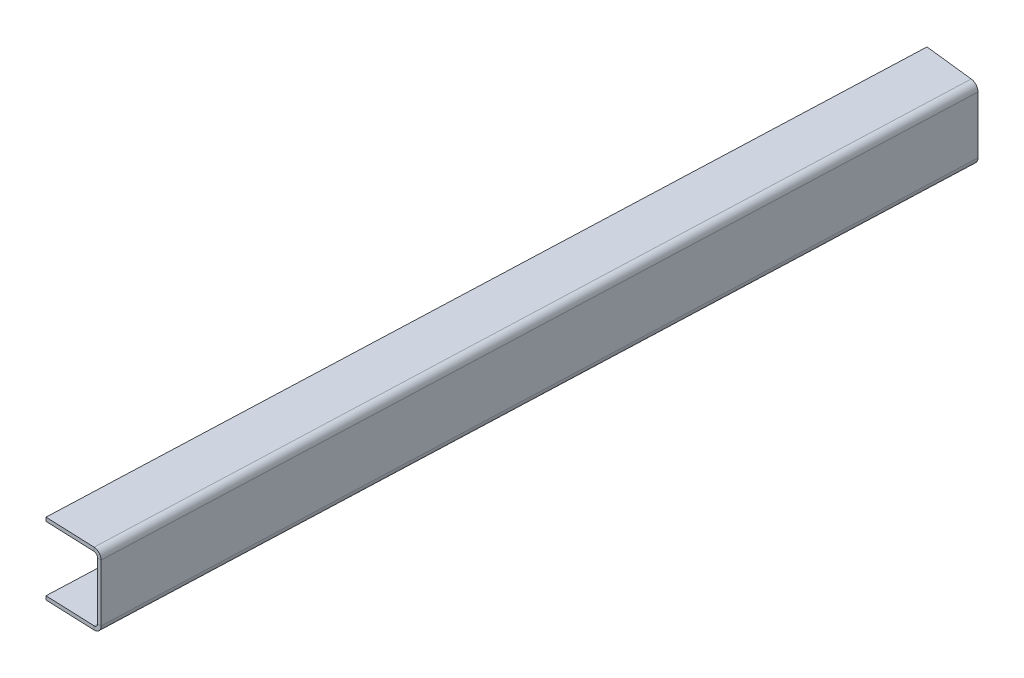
ISO-10303-21;
HEADER;
FILE_DESCRIPTION(('STEP AP214'),'2;1');
FILE_NAME('part.step','',(''),(''),'','','');
FILE_SCHEMA(('AUTOMOTIVE_DESIGN { 1 0 10303 214 1 1 1 1 }'));
ENDSEC;
DATA;
#1=APPLICATION_CONTEXT('core data for automotive mechanical design processes');
#2=APPLICATION_PROTOCOL_DEFINITION('international standard','automotive_design',2000,#1);
#3=PRODUCT_CONTEXT('',#1,'mechanical');
#4=PRODUCT('Part','Part','',(#3));
#5=PRODUCT_RELATED_PRODUCT_CATEGORY('part','',(#4));
#6=PRODUCT_DEFINITION_FORMATION('','',#4);
#7=PRODUCT_DEFINITION_CONTEXT('part definition',#1,'design');
#8=PRODUCT_DEFINITION('design','',#6,#7);
#9=PRODUCT_DEFINITION_SHAPE('','',#8);
#10=(LENGTH_UNIT() NAMED_UNIT(*) SI_UNIT(.MILLI.,.METRE.));
#11=(NAMED_UNIT(*) PLANE_ANGLE_UNIT() SI_UNIT($,.RADIAN.));
#12=(NAMED_UNIT(*) SI_UNIT($,.STERADIAN.) SOLID_ANGLE_UNIT());
#13=UNCERTAINTY_MEASURE_WITH_UNIT(LENGTH_MEASURE(1.E-05),#10,'distance_accuracy_value','');
#14=(GEOMETRIC_REPRESENTATION_CONTEXT(3) GLOBAL_UNCERTAINTY_ASSIGNED_CONTEXT((#13)) GLOBAL_UNIT_ASSIGNED_CONTEXT((#10,
#11,#12)) REPRESENTATION_CONTEXT('',''));
#15=CARTESIAN_POINT('',(0.,0.,0.));
#16=DIRECTION('',(0.,0.,1.));
#17=DIRECTION('',(1.,0.,0.));
#18=AXIS2_PLACEMENT_3D('',#15,#16,#17);
#19=CARTESIAN_POINT('',(601.515206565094,0.,-909.072575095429));
#20=DIRECTION('',(0.0392134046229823,0.,-0.999230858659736));
#21=DIRECTION('',(0.,1.,0.));
#22=AXIS2_PLACEMENT_3D('',#19,#20,#21);
#23=PLANE('',#22);
#24=DIRECTION('',(-0.999230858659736,0.,-0.0392134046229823));
#25=VECTOR('',#24,1.);
#26=CARTESIAN_POINT('',(601.515206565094,411.337158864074,-909.072575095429));
#27=LINE('',#26,#25);
#28=CARTESIAN_POINT('',(603.139556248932,411.337158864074,-909.008829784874));
#29=VERTEX_POINT('',#28);
#30=CARTESIAN_POINT('',(601.515206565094,411.337158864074,-909.072575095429));
#31=VERTEX_POINT('',#30);
#32=EDGE_CURVE('E12',#29,#31,#27,.T.);
#33=ORIENTED_EDGE('',*,*,#32,.F.);
#34=DIRECTION('',(0.,1.,0.));
#35=VECTOR('',#34,1.);
#36=CARTESIAN_POINT('',(603.139556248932,0.,-909.008829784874));
#37=LINE('',#36,#35);
#38=CARTESIAN_POINT('',(603.139556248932,436.584758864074,-909.008829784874));
#39=VERTEX_POINT('',#38);
#40=EDGE_CURVE('E137',#29,#39,#37,.T.);
#41=ORIENTED_EDGE('',*,*,#40,.T.);
#42=DIRECTION('',(-0.999230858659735,0.,-0.0392134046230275));
#43=VECTOR('',#42,1.);
#44=CARTESIAN_POINT('',(601.515206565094,436.584758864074,-909.072575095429));
#45=LINE('',#44,#43);
#46=CARTESIAN_POINT('',(601.515206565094,436.584758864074,-909.072575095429));
#47=VERTEX_POINT('',#46);
#48=EDGE_CURVE('E90',#39,#47,#45,.T.);
#49=ORIENTED_EDGE('',*,*,#48,.T.);
#50=DIRECTION('',(0.,1.,0.));
#51=VECTOR('',#50,1.);
#52=CARTESIAN_POINT('',(601.515206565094,0.,-909.072575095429));
#53=LINE('',#52,#51);
#54=EDGE_CURVE('E139',#31,#47,#53,.T.);
#55=ORIENTED_EDGE('',*,*,#54,.F.);
#56=EDGE_LOOP('',(#33,#41,#49,#55));
#57=FACE_BOUND('',#56,.T.);
#58=ADVANCED_FACE('F78',(#57),#23,.F.);
#59=CARTESIAN_POINT('',(598.266578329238,436.584758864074,-909.201878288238));
#60=CARTESIAN_POINT('',(597.725128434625,436.584758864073,-909.22312672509));
#61=CARTESIAN_POINT('',(597.183678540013,436.584758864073,-909.244375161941));
#62=CARTESIAN_POINT('',(596.6422286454,436.584758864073,-909.265623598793));
#63=CARTESIAN_POINT('',(598.266578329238,433.333558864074,-909.201878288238));
#64=CARTESIAN_POINT('',(597.725128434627,432.24982553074,-909.22312672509));
#65=CARTESIAN_POINT('',(597.183678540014,431.166092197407,-909.244375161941));
#66=CARTESIAN_POINT('',(596.642228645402,430.082358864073,-909.265623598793));
#67=CARTESIAN_POINT('',(601.515206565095,433.333558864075,-909.07257509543));
#68=CARTESIAN_POINT('',(602.056656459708,432.249825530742,-909.051326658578));
#69=CARTESIAN_POINT('',(602.598106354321,431.166092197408,-909.030078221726));
#70=CARTESIAN_POINT('',(603.139556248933,430.082358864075,-909.008829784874));
#71=CARTESIAN_POINT('',(601.515206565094,436.584758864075,-909.072575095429));
#72=CARTESIAN_POINT('',(602.056656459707,436.584758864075,-909.051326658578));
#73=CARTESIAN_POINT('',(602.598106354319,436.584758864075,-909.030078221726));
#74=CARTESIAN_POINT('',(603.139556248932,436.584758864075,-909.008829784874));
#75=CARTESIAN_POINT('',(601.515206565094,439.835958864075,-909.07257509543));
#76=CARTESIAN_POINT('',(602.056656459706,440.919692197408,-909.051326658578));
#77=CARTESIAN_POINT('',(602.598106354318,442.003425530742,-909.030078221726));
#78=CARTESIAN_POINT('',(603.13955624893,443.087158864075,-909.008829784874));
#79=CARTESIAN_POINT('',(598.266578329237,439.835958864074,-909.201878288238));
#80=CARTESIAN_POINT('',(597.725128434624,440.919692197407,-909.22312672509));
#81=CARTESIAN_POINT('',(597.183678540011,442.00342553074,-909.244375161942));
#82=CARTESIAN_POINT('',(596.642228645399,443.087158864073,-909.265623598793));
#83=CARTESIAN_POINT('',(598.266578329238,436.584758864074,-909.201878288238));
#84=CARTESIAN_POINT('',(597.725128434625,436.584758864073,-909.22312672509));
#85=CARTESIAN_POINT('',(597.183678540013,436.584758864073,-909.244375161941));
#86=CARTESIAN_POINT('',(596.6422286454,436.584758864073,-909.265623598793));
#87=(BOUNDED_SURFACE() B_SPLINE_SURFACE(3,3,((#59,#60,#61,#62),(#63,#64,#65,#66),(#67,#68,#69,
#70),(#71,#72,#73,#74),(#75,#76,#77,#78),(#79,#80,#81,#82),(#83,#84,#85,#86)),.UNSPECIFIED.,.T.,
.F.,.F.) B_SPLINE_SURFACE_WITH_KNOTS((4,3,4),(4,4),(0.,0.5,1.),(0.,1.),
.UNSPECIFIED.) GEOMETRIC_REPRESENTATION_ITEM() RATIONAL_B_SPLINE_SURFACE(((1.,1.,1.,1.),
(0.333333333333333,0.333333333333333,0.333333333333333,0.333333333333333),(0.333333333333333,
0.333333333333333,0.333333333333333,0.333333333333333),(1.,1.,1.,1.),(0.333333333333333,
0.333333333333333,0.333333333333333,0.333333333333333),(0.333333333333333,0.333333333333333,
0.333333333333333,0.333333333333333),(1.,1.,1.,1.))) REPRESENTATION_ITEM('') SURFACE());
#88=CARTESIAN_POINT('',(599.890892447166,436.584758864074,-909.137226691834));
#89=DIRECTION('',(-0.0394921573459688,0.,0.999219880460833));
#90=DIRECTION('',(-0.999219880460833,-2.73184788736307E-13,-0.0394921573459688));
#91=AXIS2_PLACEMENT_3D('',#88,#89,#90);
#92=ELLIPSE('',#91,3.25120012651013,3.2512);
#93=CARTESIAN_POINT('',(599.890892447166,439.835958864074,-909.137226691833));
#94=VERTEX_POINT('',#93);
#95=EDGE_CURVE('E215',#39,#94,#92,.T.);
#96=DIRECTION('',(0.,-1.,0.));
#97=VECTOR('',#96,1.);
#98=CARTESIAN_POINT('',(599.890892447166,438.210358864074,-909.137226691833));
#99=LINE('',#98,#97);
#100=CARTESIAN_POINT('',(599.890892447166,438.210358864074,-909.137226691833));
#101=VERTEX_POINT('',#100);
#102=EDGE_CURVE('E205',#94,#101,#99,.T.);
#103=CARTESIAN_POINT('',(599.890892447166,436.584758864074,-909.137226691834));
#104=DIRECTION('',(-0.0397709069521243,0.,0.999208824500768));
#105=DIRECTION('',(-0.999208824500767,-2.66339171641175E-13,-0.0397709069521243));
#106=AXIS2_PLACEMENT_3D('',#103,#104,#105);
#107=ELLIPSE('',#106,1.62560025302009,1.6256);
#108=EDGE_CURVE('E213',#47,#101,#107,.T.);
#109=ORIENTED_EDGE('',*,*,#48,.F.);
#110=ORIENTED_EDGE('',*,*,#95,.T.);
#111=ORIENTED_EDGE('',*,*,#102,.T.);
#112=ORIENTED_EDGE('',*,*,#108,.F.);
#113=EDGE_LOOP('',(#109,#110,#111,#112));
#114=FACE_BOUND('',#113,.T.);
#115=ADVANCED_FACE('F212',(#114),#87,.F.);
#116=CARTESIAN_POINT('',(577.755221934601,438.210358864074,-910.018279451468));
#117=DIRECTION('',(-0.0397709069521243,0.,0.999208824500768));
#118=DIRECTION('',(0.999208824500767,0.,0.0397709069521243));
#119=AXIS2_PLACEMENT_3D('',#116,#117,#118);
#120=PLANE('',#119);
#121=ORIENTED_EDGE('',*,*,#102,.F.);
#122=DIRECTION('',(0.999208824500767,0.,0.0397709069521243));
#123=VECTOR('',#122,1.);
#124=CARTESIAN_POINT('',(577.755221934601,439.835958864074,-910.018279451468));
#125=LINE('',#124,#123);
#126=CARTESIAN_POINT('',(577.755221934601,439.835958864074,-910.018279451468));
#127=VERTEX_POINT('',#126);
#128=EDGE_CURVE('E176',#127,#94,#125,.T.);
#129=ORIENTED_EDGE('',*,*,#128,.F.);
#130=DIRECTION('',(0.,-1.,0.));
#131=VECTOR('',#130,1.);
#132=CARTESIAN_POINT('',(577.755221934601,438.210358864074,-910.018279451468));
#133=LINE('',#132,#131);
#134=CARTESIAN_POINT('',(577.755221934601,438.210358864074,-910.018279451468));
#135=VERTEX_POINT('',#134);
#136=EDGE_CURVE('E202',#127,#135,#133,.T.);
#137=ORIENTED_EDGE('',*,*,#136,.T.);
#138=DIRECTION('',(0.999208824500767,0.,0.0397709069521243));
#139=VECTOR('',#138,1.);
#140=CARTESIAN_POINT('',(577.755221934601,438.210358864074,-910.018279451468));
#141=LINE('',#140,#139);
#142=EDGE_CURVE('E232',#135,#101,#141,.T.);
#143=ORIENTED_EDGE('',*,*,#142,.T.);
#144=EDGE_LOOP('',(#121,#129,#137,#143));
#145=FACE_BOUND('',#144,.T.);
#146=ADVANCED_FACE('F233',(#145),#120,.T.);
#147=CARTESIAN_POINT('',(592.476582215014,438.210358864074,-1285.14606075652));
#148=DIRECTION('',(-0.999230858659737,0.,-0.0392134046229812));
#149=DIRECTION('',(-0.0392134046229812,0.,0.999230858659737));
#150=AXIS2_PLACEMENT_3D('',#147,#148,#149);
#151=PLANE('',#150);
#152=ORIENTED_EDGE('',*,*,#136,.F.);
#153=DIRECTION('',(-0.0392134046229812,0.,0.999230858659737));
#154=VECTOR('',#153,1.);
#155=CARTESIAN_POINT('',(592.476582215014,439.835958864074,-1285.14606075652));
#156=LINE('',#155,#154);
#157=CARTESIAN_POINT('',(592.476582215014,439.835958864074,-1285.14606075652));
#158=VERTEX_POINT('',#157);
#159=EDGE_CURVE('E168',#158,#127,#156,.T.);
#160=ORIENTED_EDGE('',*,*,#159,.F.);
#161=DIRECTION('',(0.,-1.,0.));
#162=VECTOR('',#161,1.);
#163=CARTESIAN_POINT('',(592.476582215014,438.210358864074,-1285.14606075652));
#164=LINE('',#163,#162);
#165=CARTESIAN_POINT('',(592.476582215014,438.210358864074,-1285.14606075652));
#166=VERTEX_POINT('',#165);
#167=EDGE_CURVE('E199',#158,#166,#164,.T.);
#168=ORIENTED_EDGE('',*,*,#167,.T.);
#169=DIRECTION('',(-0.0392134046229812,0.,0.999230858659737));
#170=VECTOR('',#169,1.);
#171=CARTESIAN_POINT('',(592.476582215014,438.210358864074,-1285.14606075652));
#172=LINE('',#171,#170);
#173=EDGE_CURVE('E237',#166,#135,#172,.T.);
#174=ORIENTED_EDGE('',*,*,#173,.T.);
#175=EDGE_LOOP('',(#152,#160,#168,#174));
#176=FACE_BOUND('',#175,.T.);
#177=ADVANCED_FACE('F280',(#176),#151,.T.);
#178=CARTESIAN_POINT('',(617.783663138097,438.210358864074,-1282.28010713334));
#179=DIRECTION('',(0.112527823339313,0.,-0.993648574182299));
#180=DIRECTION('',(-0.993648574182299,0.,-0.112527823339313));
#181=AXIS2_PLACEMENT_3D('',#178,#179,#180);
#182=PLANE('',#181);
#183=ORIENTED_EDGE('',*,*,#167,.F.);
#184=DIRECTION('',(-0.993648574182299,0.,-0.112527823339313));
#185=VECTOR('',#184,1.);
#186=CARTESIAN_POINT('',(617.783663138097,439.835958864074,-1282.28010713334));
#187=LINE('',#186,#185);
#188=CARTESIAN_POINT('',(614.548734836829,439.835958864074,-1282.64645339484));
#189=VERTEX_POINT('',#188);
#190=EDGE_CURVE('E173',#189,#158,#187,.T.);
#191=ORIENTED_EDGE('',*,*,#190,.F.);
#192=DIRECTION('',(0.,-1.,-1.3659239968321E-13));
#193=VECTOR('',#192,1.);
#194=CARTESIAN_POINT('',(614.548734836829,438.210358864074,-1282.64645339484));
#195=LINE('',#194,#193);
#196=CARTESIAN_POINT('',(614.548734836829,438.210358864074,-1282.64645339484));
#197=VERTEX_POINT('',#196);
#198=EDGE_CURVE('E196',#189,#197,#195,.T.);
#199=ORIENTED_EDGE('',*,*,#198,.T.);
#200=DIRECTION('',(-0.993648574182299,0.,-0.112527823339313));
#201=VECTOR('',#200,1.);
#202=CARTESIAN_POINT('',(617.783663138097,438.210358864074,-1282.28010713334));
#203=LINE('',#202,#201);
#204=EDGE_CURVE('E238',#197,#166,#203,.T.);
#205=ORIENTED_EDGE('',*,*,#204,.T.);
#206=EDGE_LOOP('',(#183,#191,#199,#205));
#207=FACE_BOUND('',#206,.T.);
#208=ADVANCED_FACE('F307',(#207),#182,.T.);
#209=CARTESIAN_POINT('',(612.929081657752,436.584758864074,-1282.82987442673));
#210=CARTESIAN_POINT('',(612.387631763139,436.584758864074,-1282.85112286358));
#211=CARTESIAN_POINT('',(611.846181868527,436.584758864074,-1282.87237130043));
#212=CARTESIAN_POINT('',(611.304731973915,436.584758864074,-1282.89361973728));
#213=CARTESIAN_POINT('',(612.929081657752,439.835958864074,-1282.82987442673));
#214=CARTESIAN_POINT('',(612.38763176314,440.919692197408,-1282.85112286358));
#215=CARTESIAN_POINT('',(611.846181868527,442.003425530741,-1282.87237130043));
#216=CARTESIAN_POINT('',(611.304731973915,443.087158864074,-1282.89361973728));
#217=CARTESIAN_POINT('',(616.168388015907,439.835958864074,-1282.46303236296));
#218=CARTESIAN_POINT('',(616.709837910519,440.919692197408,-1282.44178392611));
#219=CARTESIAN_POINT('',(617.251287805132,442.003425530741,-1282.42053548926));
#220=CARTESIAN_POINT('',(617.792737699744,443.087158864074,-1282.3992870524));
#221=CARTESIAN_POINT('',(616.168388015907,436.584758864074,-1282.46303236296));
#222=CARTESIAN_POINT('',(616.709837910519,436.584758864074,-1282.44178392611));
#223=CARTESIAN_POINT('',(617.251287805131,436.584758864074,-1282.42053548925));
#224=CARTESIAN_POINT('',(617.792737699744,436.584758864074,-1282.3992870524));
#225=CARTESIAN_POINT('',(616.168388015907,433.333558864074,-1282.46303236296));
#226=CARTESIAN_POINT('',(616.709837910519,432.249825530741,-1282.44178392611));
#227=CARTESIAN_POINT('',(617.251287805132,431.166092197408,-1282.42053548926));
#228=CARTESIAN_POINT('',(617.792737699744,430.082358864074,-1282.3992870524));
#229=CARTESIAN_POINT('',(612.929081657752,433.333558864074,-1282.82987442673));
#230=CARTESIAN_POINT('',(612.38763176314,432.249825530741,-1282.85112286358));
#231=CARTESIAN_POINT('',(611.846181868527,431.166092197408,-1282.87237130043));
#232=CARTESIAN_POINT('',(611.304731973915,430.082358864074,-1282.89361973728));
#233=CARTESIAN_POINT('',(612.929081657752,436.584758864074,-1282.82987442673));
#234=CARTESIAN_POINT('',(612.387631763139,436.584758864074,-1282.85112286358));
#235=CARTESIAN_POINT('',(611.846181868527,436.584758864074,-1282.87237130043));
#236=CARTESIAN_POINT('',(611.304731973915,436.584758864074,-1282.89361973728));
#237=(BOUNDED_SURFACE() B_SPLINE_SURFACE(3,3,((#209,#210,#211,#212),(#213,#214,#215,#216),(#217,
#218,#219,#220),(#221,#222,#223,#224),(#225,#226,#227,#228),(#229,#230,#231,#232),(#233,#234,
#235,#236)),.UNSPECIFIED.,.T.,.F.,.F.) B_SPLINE_SURFACE_WITH_KNOTS((4,3,4),(4,4),(0.,0.5,1.),
(0.,1.),.UNSPECIFIED.) GEOMETRIC_REPRESENTATION_ITEM() RATIONAL_B_SPLINE_SURFACE(((1.,1.,1.,1.),
(0.333333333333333,0.333333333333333,0.333333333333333,0.333333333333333),(0.333333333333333,
0.333333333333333,0.333333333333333,0.333333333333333),(1.,1.,1.,1.),(0.333333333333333,
0.333333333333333,0.333333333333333,0.333333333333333),(0.333333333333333,0.333333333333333,
0.333333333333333,0.333333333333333),(1.,1.,1.,1.))) REPRESENTATION_ITEM('') SURFACE());
#238=CARTESIAN_POINT('',(614.548734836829,436.584758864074,-1282.64645339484));
#239=DIRECTION('',(0.0759715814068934,0.,-0.997109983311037));
#240=DIRECTION('',(-0.997109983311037,0.,-0.0759715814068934));
#241=AXIS2_PLACEMENT_3D('',#238,#239,#240);
#242=ELLIPSE('',#241,3.25340525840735,3.2512);
#243=CARTESIAN_POINT('',(617.792737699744,436.584758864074,-1282.3992870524));
#244=VERTEX_POINT('',#243);
#245=EDGE_CURVE('E178',#189,#244,#242,.T.);
#246=DIRECTION('',(-0.999230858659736,0.,-0.0392134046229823));
#247=VECTOR('',#246,1.);
#248=CARTESIAN_POINT('',(616.168388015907,436.584758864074,-1282.46303236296));
#249=LINE('',#248,#247);
#250=CARTESIAN_POINT('',(616.168388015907,436.584758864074,-1282.46303236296));
#251=VERTEX_POINT('',#250);
#252=EDGE_CURVE('E194',#244,#251,#249,.T.);
#253=CARTESIAN_POINT('',(614.548734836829,436.584758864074,-1282.64645339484));
#254=DIRECTION('',(0.112527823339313,0.,-0.993648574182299));
#255=DIRECTION('',(-0.993648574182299,0.,-0.112527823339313));
#256=AXIS2_PLACEMENT_3D('',#253,#254,#255);
#257=ELLIPSE('',#256,1.6300060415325,1.6256);
#258=EDGE_CURVE('E229',#197,#251,#257,.T.);
#259=ORIENTED_EDGE('',*,*,#198,.F.);
#260=ORIENTED_EDGE('',*,*,#245,.T.);
#261=ORIENTED_EDGE('',*,*,#252,.T.);
#262=ORIENTED_EDGE('',*,*,#258,.F.);
#263=EDGE_LOOP('',(#259,#260,#261,#262));
#264=FACE_BOUND('',#263,.T.);
#265=ADVANCED_FACE('F357',(#264),#237,.F.);
#266=CARTESIAN_POINT('',(616.168388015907,0.,-1282.46303236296));
#267=DIRECTION('',(-0.0392134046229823,0.,0.999230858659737));
#268=DIRECTION('',(0.,-1.,0.));
#269=AXIS2_PLACEMENT_3D('',#266,#267,#268);
#270=PLANE('',#269);
#271=ORIENTED_EDGE('',*,*,#252,.F.);
#272=DIRECTION('',(0.,1.,0.));
#273=VECTOR('',#272,1.);
#274=CARTESIAN_POINT('',(617.792737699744,0.,-1282.3992870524));
#275=LINE('',#274,#273);
#276=CARTESIAN_POINT('',(617.792737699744,411.337158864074,-1282.3992870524));
#277=VERTEX_POINT('',#276);
#278=EDGE_CURVE('E167',#244,#277,#275,.F.);
#279=ORIENTED_EDGE('',*,*,#278,.T.);
#280=DIRECTION('',(-0.999230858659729,0.,-0.0392134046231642));
#281=VECTOR('',#280,1.);
#282=CARTESIAN_POINT('',(616.168388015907,411.337158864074,-1282.46303236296));
#283=LINE('',#282,#281);
#284=CARTESIAN_POINT('',(616.168388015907,411.337158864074,-1282.46303236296));
#285=VERTEX_POINT('',#284);
#286=EDGE_CURVE('E191',#277,#285,#283,.T.);
#287=ORIENTED_EDGE('',*,*,#286,.T.);
#288=DIRECTION('',(0.,-1.,0.));
#289=VECTOR('',#288,1.);
#290=CARTESIAN_POINT('',(616.168388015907,0.,-1282.46303236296));
#291=LINE('',#290,#289);
#292=EDGE_CURVE('E284',#251,#285,#291,.T.);
#293=ORIENTED_EDGE('',*,*,#292,.F.);
#294=EDGE_LOOP('',(#271,#279,#287,#293));
#295=FACE_BOUND('',#294,.T.);
#296=ADVANCED_FACE('F322',(#295),#270,.F.);
#297=CARTESIAN_POINT('',(616.168388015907,411.337158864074,-1282.46303236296));
#298=CARTESIAN_POINT('',(616.709837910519,411.337158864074,-1282.44178392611));
#299=CARTESIAN_POINT('',(617.251287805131,411.337158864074,-1282.42053548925));
#300=CARTESIAN_POINT('',(617.792737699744,411.337158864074,-1282.3992870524));
#301=CARTESIAN_POINT('',(616.168388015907,408.085958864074,-1282.46303236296));
#302=CARTESIAN_POINT('',(616.709837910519,407.00222553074,-1282.44178392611));
#303=CARTESIAN_POINT('',(617.251287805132,405.918492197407,-1282.42053548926));
#304=CARTESIAN_POINT('',(617.792737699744,404.834758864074,-1282.3992870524));
#305=CARTESIAN_POINT('',(612.929081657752,408.085958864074,-1282.82987442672));
#306=CARTESIAN_POINT('',(612.387631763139,407.00222553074,-1282.85112286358));
#307=CARTESIAN_POINT('',(611.846181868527,405.918492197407,-1282.87237130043));
#308=CARTESIAN_POINT('',(611.304731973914,404.834758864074,-1282.89361973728));
#309=CARTESIAN_POINT('',(612.929081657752,411.337158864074,-1282.82987442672));
#310=CARTESIAN_POINT('',(612.387631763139,411.337158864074,-1282.85112286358));
#311=CARTESIAN_POINT('',(611.846181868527,411.337158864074,-1282.87237130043));
#312=CARTESIAN_POINT('',(611.304731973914,411.337158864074,-1282.89361973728));
#313=CARTESIAN_POINT('',(612.929081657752,414.588358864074,-1282.82987442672));
#314=CARTESIAN_POINT('',(612.387631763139,415.672092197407,-1282.85112286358));
#315=CARTESIAN_POINT('',(611.846181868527,416.755825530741,-1282.87237130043));
#316=CARTESIAN_POINT('',(611.304731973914,417.839558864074,-1282.89361973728));
#317=CARTESIAN_POINT('',(616.168388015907,414.588358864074,-1282.46303236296));
#318=CARTESIAN_POINT('',(616.709837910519,415.672092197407,-1282.44178392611));
#319=CARTESIAN_POINT('',(617.251287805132,416.755825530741,-1282.42053548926));
#320=CARTESIAN_POINT('',(617.792737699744,417.839558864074,-1282.3992870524));
#321=CARTESIAN_POINT('',(616.168388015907,411.337158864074,-1282.46303236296));
#322=CARTESIAN_POINT('',(616.709837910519,411.337158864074,-1282.44178392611));
#323=CARTESIAN_POINT('',(617.251287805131,411.337158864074,-1282.42053548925));
#324=CARTESIAN_POINT('',(617.792737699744,411.337158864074,-1282.3992870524));
#325=(BOUNDED_SURFACE() B_SPLINE_SURFACE(3,3,((#297,#298,#299,#300),(#301,#302,#303,#304),(#305,
#306,#307,#308),(#309,#310,#311,#312),(#313,#314,#315,#316),(#317,#318,#319,#320),(#321,#322,
#323,#324)),.UNSPECIFIED.,.T.,.F.,.F.) B_SPLINE_SURFACE_WITH_KNOTS((4,3,4),(4,4),(0.,0.5,1.),
(0.,1.),.UNSPECIFIED.) GEOMETRIC_REPRESENTATION_ITEM() RATIONAL_B_SPLINE_SURFACE(((1.,1.,1.,1.),
(0.333333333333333,0.333333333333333,0.333333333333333,0.333333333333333),(0.333333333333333,
0.333333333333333,0.333333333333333,0.333333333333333),(1.,1.,1.,1.),(0.333333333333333,
0.333333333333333,0.333333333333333,0.333333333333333),(0.333333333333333,0.333333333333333,
0.333333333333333,0.333333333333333),(1.,1.,1.,1.))) REPRESENTATION_ITEM('') SURFACE());
#326=CARTESIAN_POINT('',(614.548734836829,411.337158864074,-1282.64645339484));
#327=DIRECTION('',(0.0759715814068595,0.,-0.997109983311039));
#328=DIRECTION('',(0.997109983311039,0.,0.0759715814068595));
#329=AXIS2_PLACEMENT_3D('',#326,#327,#328);
#330=ELLIPSE('',#329,3.25340525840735,3.2512);
#331=CARTESIAN_POINT('',(614.548734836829,408.085958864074,-1282.64645339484));
#332=VERTEX_POINT('',#331);
#333=EDGE_CURVE('E155',#277,#332,#330,.T.);
#334=DIRECTION('',(0.,1.,0.));
#335=VECTOR('',#334,1.);
#336=CARTESIAN_POINT('',(614.548734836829,409.711558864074,-1282.64645339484));
#337=LINE('',#336,#335);
#338=CARTESIAN_POINT('',(614.548734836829,409.711558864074,-1282.64645339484));
#339=VERTEX_POINT('',#338);
#340=EDGE_CURVE('E188',#332,#339,#337,.T.);
#341=CARTESIAN_POINT('',(614.548734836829,411.337158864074,-1282.64645339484));
#342=DIRECTION('',(0.112527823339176,0.,-0.993648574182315));
#343=DIRECTION('',(0.993648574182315,0.,0.112527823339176));
#344=AXIS2_PLACEMENT_3D('',#341,#342,#343);
#345=ELLIPSE('',#344,1.63000604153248,1.6256);
#346=EDGE_CURVE('E254',#285,#339,#345,.T.);
#347=ORIENTED_EDGE('',*,*,#286,.F.);
#348=ORIENTED_EDGE('',*,*,#333,.T.);
#349=ORIENTED_EDGE('',*,*,#340,.T.);
#350=ORIENTED_EDGE('',*,*,#346,.F.);
#351=EDGE_LOOP('',(#347,#348,#349,#350));
#352=FACE_BOUND('',#351,.T.);
#353=ADVANCED_FACE('F326',(#352),#325,.F.);
#354=CARTESIAN_POINT('',(592.476582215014,409.711558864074,-1285.14606075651));
#355=DIRECTION('',(0.112527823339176,0.,-0.993648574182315));
#356=DIRECTION('',(0.993648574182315,0.,0.112527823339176));
#357=AXIS2_PLACEMENT_3D('',#354,#355,#356);
#358=PLANE('',#357);
#359=ORIENTED_EDGE('',*,*,#340,.F.);
#360=DIRECTION('',(0.993648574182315,0.,0.112527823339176));
#361=VECTOR('',#360,1.);
#362=CARTESIAN_POINT('',(592.476582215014,408.085958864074,-1285.14606075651));
#363=LINE('',#362,#361);
#364=CARTESIAN_POINT('',(592.476582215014,408.085958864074,-1285.14606075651));
#365=VERTEX_POINT('',#364);
#366=EDGE_CURVE('E262',#365,#332,#363,.T.);
#367=ORIENTED_EDGE('',*,*,#366,.F.);
#368=DIRECTION('',(0.,1.,0.));
#369=VECTOR('',#368,1.);
#370=CARTESIAN_POINT('',(592.476582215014,409.711558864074,-1285.14606075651));
#371=LINE('',#370,#369);
#372=CARTESIAN_POINT('',(592.476582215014,409.711558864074,-1285.14606075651));
#373=VERTEX_POINT('',#372);
#374=EDGE_CURVE('E185',#365,#373,#371,.T.);
#375=ORIENTED_EDGE('',*,*,#374,.T.);
#376=DIRECTION('',(0.993648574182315,0.,0.112527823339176));
#377=VECTOR('',#376,1.);
#378=CARTESIAN_POINT('',(592.476582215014,409.711558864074,-1285.14606075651));
#379=LINE('',#378,#377);
#380=EDGE_CURVE('E293',#373,#339,#379,.T.);
#381=ORIENTED_EDGE('',*,*,#380,.T.);
#382=EDGE_LOOP('',(#359,#367,#375,#381));
#383=FACE_BOUND('',#382,.T.);
#384=ADVANCED_FACE('F374',(#383),#358,.T.);
#385=CARTESIAN_POINT('',(577.755221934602,409.711558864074,-910.018279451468));
#386=DIRECTION('',(-0.999230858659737,0.,-0.0392134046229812));
#387=DIRECTION('',(0.0392134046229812,0.,-0.999230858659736));
#388=AXIS2_PLACEMENT_3D('',#385,#386,#387);
#389=PLANE('',#388);
#390=ORIENTED_EDGE('',*,*,#374,.F.);
#391=DIRECTION('',(0.0392134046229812,0.,-0.999230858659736));
#392=VECTOR('',#391,1.);
#393=CARTESIAN_POINT('',(577.755221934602,408.085958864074,-910.018279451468));
#394=LINE('',#393,#392);
#395=CARTESIAN_POINT('',(577.755221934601,408.085958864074,-910.018279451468));
#396=VERTEX_POINT('',#395);
#397=EDGE_CURVE('E255',#396,#365,#394,.T.);
#398=ORIENTED_EDGE('',*,*,#397,.F.);
#399=DIRECTION('',(0.,1.,0.));
#400=VECTOR('',#399,1.);
#401=CARTESIAN_POINT('',(577.755221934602,409.711558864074,-910.018279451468));
#402=LINE('',#401,#400);
#403=CARTESIAN_POINT('',(577.755221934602,409.711558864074,-910.018279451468));
#404=VERTEX_POINT('',#403);
#405=EDGE_CURVE('E182',#396,#404,#402,.T.);
#406=ORIENTED_EDGE('',*,*,#405,.T.);
#407=DIRECTION('',(0.0392134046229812,0.,-0.999230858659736));
#408=VECTOR('',#407,1.);
#409=CARTESIAN_POINT('',(577.755221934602,409.711558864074,-910.018279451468));
#410=LINE('',#409,#408);
#411=EDGE_CURVE('E296',#404,#373,#410,.T.);
#412=ORIENTED_EDGE('',*,*,#411,.T.);
#413=EDGE_LOOP('',(#390,#398,#406,#412));
#414=FACE_BOUND('',#413,.T.);
#415=ADVANCED_FACE('F382',(#414),#389,.T.);
#416=CARTESIAN_POINT('',(603.135130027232,409.711558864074,-909.008098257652));
#417=DIRECTION('',(-0.0397709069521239,0.,0.999208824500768));
#418=DIRECTION('',(-0.999208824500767,0.,-0.0397709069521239));
#419=AXIS2_PLACEMENT_3D('',#416,#417,#418);
#420=PLANE('',#419);
#421=ORIENTED_EDGE('',*,*,#405,.F.);
#422=DIRECTION('',(-0.999208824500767,0.,-0.0397709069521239));
#423=VECTOR('',#422,1.);
#424=CARTESIAN_POINT('',(603.135130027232,408.085958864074,-909.008098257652));
#425=LINE('',#424,#423);
#426=CARTESIAN_POINT('',(599.890892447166,408.085958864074,-909.137226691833));
#427=VERTEX_POINT('',#426);
#428=EDGE_CURVE('E259',#427,#396,#425,.T.);
#429=ORIENTED_EDGE('',*,*,#428,.F.);
#430=DIRECTION('',(0.,1.,-1.36592399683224E-13));
#431=VECTOR('',#430,1.);
#432=CARTESIAN_POINT('',(599.890892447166,409.711558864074,-909.137226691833));
#433=LINE('',#432,#431);
#434=CARTESIAN_POINT('',(599.890892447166,409.711558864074,-909.137226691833));
#435=VERTEX_POINT('',#434);
#436=EDGE_CURVE('E84',#427,#435,#433,.T.);
#437=ORIENTED_EDGE('',*,*,#436,.T.);
#438=DIRECTION('',(-0.999208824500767,0.,-0.0397709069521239));
#439=VECTOR('',#438,1.);
#440=CARTESIAN_POINT('',(603.135130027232,409.711558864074,-909.008098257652));
#441=LINE('',#440,#439);
#442=EDGE_CURVE('E290',#435,#404,#441,.T.);
#443=ORIENTED_EDGE('',*,*,#442,.T.);
#444=EDGE_LOOP('',(#421,#429,#437,#443));
#445=FACE_BOUND('',#444,.T.);
#446=ADVANCED_FACE('F386',(#445),#420,.T.);
#447=CARTESIAN_POINT('',(601.515206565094,411.337158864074,-909.072575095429));
#448=CARTESIAN_POINT('',(602.056656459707,411.337158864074,-909.051326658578));
#449=CARTESIAN_POINT('',(602.598106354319,411.337158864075,-909.030078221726));
#450=CARTESIAN_POINT('',(603.139556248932,411.337158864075,-909.008829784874));
#451=CARTESIAN_POINT('',(601.515206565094,414.588358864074,-909.072575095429));
#452=CARTESIAN_POINT('',(602.056656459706,415.672092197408,-909.051326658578));
#453=CARTESIAN_POINT('',(602.598106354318,416.755825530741,-909.030078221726));
#454=CARTESIAN_POINT('',(603.13955624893,417.839558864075,-909.008829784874));
#455=CARTESIAN_POINT('',(598.266578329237,414.588358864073,-909.201878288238));
#456=CARTESIAN_POINT('',(597.725128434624,415.672092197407,-909.22312672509));
#457=CARTESIAN_POINT('',(597.183678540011,416.75582553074,-909.244375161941));
#458=CARTESIAN_POINT('',(596.642228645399,417.839558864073,-909.265623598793));
#459=CARTESIAN_POINT('',(598.266578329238,411.337158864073,-909.201878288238));
#460=CARTESIAN_POINT('',(597.725128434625,411.337158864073,-909.223126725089));
#461=CARTESIAN_POINT('',(597.183678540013,411.337158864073,-909.244375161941));
#462=CARTESIAN_POINT('',(596.6422286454,411.337158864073,-909.265623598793));
#463=CARTESIAN_POINT('',(598.266578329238,408.085958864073,-909.201878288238));
#464=CARTESIAN_POINT('',(597.725128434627,407.00222553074,-909.22312672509));
#465=CARTESIAN_POINT('',(597.183678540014,405.918492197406,-909.244375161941));
#466=CARTESIAN_POINT('',(596.642228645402,404.834758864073,-909.265623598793));
#467=CARTESIAN_POINT('',(601.515206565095,408.085958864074,-909.072575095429));
#468=CARTESIAN_POINT('',(602.056656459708,407.002225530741,-909.051326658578));
#469=CARTESIAN_POINT('',(602.598106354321,405.918492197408,-909.030078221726));
#470=CARTESIAN_POINT('',(603.139556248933,404.834758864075,-909.008829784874));
#471=CARTESIAN_POINT('',(601.515206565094,411.337158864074,-909.072575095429));
#472=CARTESIAN_POINT('',(602.056656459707,411.337158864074,-909.051326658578));
#473=CARTESIAN_POINT('',(602.598106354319,411.337158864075,-909.030078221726));
#474=CARTESIAN_POINT('',(603.139556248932,411.337158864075,-909.008829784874));
#475=(BOUNDED_SURFACE() B_SPLINE_SURFACE(3,3,((#447,#448,#449,#450),(#451,#452,#453,#454),(#455,
#456,#457,#458),(#459,#460,#461,#462),(#463,#464,#465,#466),(#467,#468,#469,#470),(#471,#472,
#473,#474)),.UNSPECIFIED.,.T.,.F.,.F.) B_SPLINE_SURFACE_WITH_KNOTS((4,3,4),(4,4),(0.,0.5,1.),
(0.,1.),.UNSPECIFIED.) GEOMETRIC_REPRESENTATION_ITEM() RATIONAL_B_SPLINE_SURFACE(((1.,1.,1.,1.),
(0.333333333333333,0.333333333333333,0.333333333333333,0.333333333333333),(0.333333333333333,
0.333333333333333,0.333333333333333,0.333333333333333),(1.,1.,1.,1.),(0.333333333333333,
0.333333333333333,0.333333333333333,0.333333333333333),(0.333333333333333,0.333333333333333,
0.333333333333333,0.333333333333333),(1.,1.,1.,1.))) REPRESENTATION_ITEM('') SURFACE());
#476=CARTESIAN_POINT('',(599.890892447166,411.337158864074,-909.137226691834));
#477=DIRECTION('',(-0.0394921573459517,0.,0.999219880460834));
#478=DIRECTION('',(0.999219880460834,2.73184788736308E-13,0.0394921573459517));
#479=AXIS2_PLACEMENT_3D('',#476,#477,#478);
#480=ELLIPSE('',#479,3.25120012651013,3.2512);
#481=EDGE_CURVE('E152',#427,#29,#480,.T.);
#482=CARTESIAN_POINT('',(599.890892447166,411.337158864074,-909.137226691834));
#483=DIRECTION('',(-0.0397709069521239,0.,0.999208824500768));
#484=DIRECTION('',(0.999208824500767,2.66339171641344E-13,0.0397709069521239));
#485=AXIS2_PLACEMENT_3D('',#482,#483,#484);
#486=ELLIPSE('',#485,1.62560025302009,1.6256);
#487=EDGE_CURVE('E250',#435,#31,#486,.T.);
#488=ORIENTED_EDGE('',*,*,#481,.T.);
#489=ORIENTED_EDGE('',*,*,#32,.T.);
#490=ORIENTED_EDGE('',*,*,#487,.F.);
#491=ORIENTED_EDGE('',*,*,#436,.F.);
#492=EDGE_LOOP('',(#488,#489,#490,#491));
#493=FACE_BOUND('',#492,.T.);
#494=ADVANCED_FACE('F80',(#493),#475,.F.);
#495=CARTESIAN_POINT('',(0.,409.711558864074,0.));
#496=DIRECTION('',(0.,-1.,0.));
#497=DIRECTION('',(0.,0.,-1.));
#498=AXIS2_PLACEMENT_3D('',#495,#496,#497);
#499=PLANE('',#498);
#500=ORIENTED_EDGE('',*,*,#442,.F.);
#501=DIRECTION('',(0.0392134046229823,0.,-0.999230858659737));
#502=VECTOR('',#501,1.);
#503=CARTESIAN_POINT('',(614.544038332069,409.711558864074,-1282.52677767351));
#504=LINE('',#503,#502);
#505=EDGE_CURVE('E247',#435,#339,#504,.T.);
#506=ORIENTED_EDGE('',*,*,#505,.T.);
#507=ORIENTED_EDGE('',*,*,#380,.F.);
#508=ORIENTED_EDGE('',*,*,#411,.F.);
#509=EDGE_LOOP('',(#500,#506,#507,#508));
#510=FACE_BOUND('',#509,.T.);
#511=ADVANCED_FACE('F411',(#510),#499,.F.);
#512=CARTESIAN_POINT('',(564.972191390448,0.,22.1117681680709));
#513=DIRECTION('',(0.999230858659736,0.,0.0392134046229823));
#514=DIRECTION('',(0.0392134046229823,0.,-0.999230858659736));
#515=AXIS2_PLACEMENT_3D('',#512,#513,#514);
#516=PLANE('',#515);
#517=ORIENTED_EDGE('',*,*,#54,.T.);
#518=DIRECTION('',(-0.0392134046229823,0.,0.999230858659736));
#519=VECTOR('',#518,1.);
#520=CARTESIAN_POINT('',(616.168388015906,436.584758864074,-1282.46303236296));
#521=LINE('',#520,#519);
#522=EDGE_CURVE('E228',#47,#251,#521,.F.);
#523=ORIENTED_EDGE('',*,*,#522,.T.);
#524=ORIENTED_EDGE('',*,*,#292,.T.);
#525=DIRECTION('',(0.0392134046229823,0.,-0.999230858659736));
#526=VECTOR('',#525,1.);
#527=CARTESIAN_POINT('',(601.515206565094,411.337158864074,-909.072575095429));
#528=LINE('',#527,#526);
#529=EDGE_CURVE('E244',#285,#31,#528,.F.);
#530=ORIENTED_EDGE('',*,*,#529,.T.);
#531=EDGE_LOOP('',(#517,#523,#524,#530));
#532=FACE_BOUND('',#531,.T.);
#533=ADVANCED_FACE('F325',(#532),#516,.F.);
#534=CARTESIAN_POINT('',(0.,438.210358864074,0.));
#535=DIRECTION('',(0.,1.,0.));
#536=DIRECTION('',(0.,0.,1.));
#537=AXIS2_PLACEMENT_3D('',#534,#535,#536);
#538=PLANE('',#537);
#539=ORIENTED_EDGE('',*,*,#204,.F.);
#540=DIRECTION('',(-0.0392134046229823,0.,0.999230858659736));
#541=VECTOR('',#540,1.);
#542=CARTESIAN_POINT('',(599.890856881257,438.210358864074,-909.136320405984));
#543=LINE('',#542,#541);
#544=EDGE_CURVE('E226',#197,#101,#543,.T.);
#545=ORIENTED_EDGE('',*,*,#544,.T.);
#546=ORIENTED_EDGE('',*,*,#142,.F.);
#547=ORIENTED_EDGE('',*,*,#173,.F.);
#548=EDGE_LOOP('',(#539,#545,#546,#547));
#549=FACE_BOUND('',#548,.T.);
#550=ADVANCED_FACE('F241',(#549),#538,.F.);
#551=CARTESIAN_POINT('',(563.345499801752,411.337158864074,22.1076989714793));
#552=DIRECTION('',(-0.0392134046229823,0.,0.999230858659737));
#553=DIRECTION('',(0.999230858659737,0.,0.0392134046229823));
#554=AXIS2_PLACEMENT_3D('',#551,#552,#553);
#555=CYLINDRICAL_SURFACE('',#554,1.6256);
#556=ORIENTED_EDGE('',*,*,#487,.T.);
#557=ORIENTED_EDGE('',*,*,#529,.F.);
#558=ORIENTED_EDGE('',*,*,#346,.T.);
#559=ORIENTED_EDGE('',*,*,#505,.F.);
#560=EDGE_LOOP('',(#556,#557,#558,#559));
#561=FACE_BOUND('',#560,.T.);
#562=ADVANCED_FACE('F327',(#561),#555,.F.);
#563=CARTESIAN_POINT('',(563.345499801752,436.584758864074,22.1076989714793));
#564=DIRECTION('',(0.0392134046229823,0.,-0.999230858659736));
#565=DIRECTION('',(-0.999230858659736,0.,-0.0392134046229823));
#566=AXIS2_PLACEMENT_3D('',#563,#564,#565);
#567=CYLINDRICAL_SURFACE('',#566,1.6256);
#568=ORIENTED_EDGE('',*,*,#258,.T.);
#569=ORIENTED_EDGE('',*,*,#522,.F.);
#570=ORIENTED_EDGE('',*,*,#108,.T.);
#571=ORIENTED_EDGE('',*,*,#544,.F.);
#572=EDGE_LOOP('',(#568,#569,#570,#571));
#573=FACE_BOUND('',#572,.T.);
#574=ADVANCED_FACE('F224',(#573),#567,.F.);
#575=CARTESIAN_POINT('',(0.,408.085958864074,0.));
#576=DIRECTION('',(0.,-1.,0.));
#577=DIRECTION('',(0.,0.,-1.));
#578=AXIS2_PLACEMENT_3D('',#575,#576,#577);
#579=PLANE('',#578);
#580=ORIENTED_EDGE('',*,*,#428,.T.);
#581=ORIENTED_EDGE('',*,*,#397,.T.);
#582=ORIENTED_EDGE('',*,*,#366,.T.);
#583=DIRECTION('',(-0.0392134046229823,0.,0.999230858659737));
#584=VECTOR('',#583,1.);
#585=CARTESIAN_POINT('',(563.345499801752,408.085958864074,22.1076989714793));
#586=LINE('',#585,#584);
#587=EDGE_CURVE('E160',#427,#332,#586,.F.);
#588=ORIENTED_EDGE('',*,*,#587,.F.);
#589=EDGE_LOOP('',(#580,#581,#582,#588));
#590=FACE_BOUND('',#589,.T.);
#591=ADVANCED_FACE('F334',(#590),#579,.T.);
#592=CARTESIAN_POINT('',(566.596541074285,0.,22.175513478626));
#593=DIRECTION('',(0.999230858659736,0.,0.0392134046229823));
#594=DIRECTION('',(0.0392134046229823,0.,-0.999230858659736));
#595=AXIS2_PLACEMENT_3D('',#592,#593,#594);
#596=PLANE('',#595);
#597=ORIENTED_EDGE('',*,*,#40,.F.);
#598=DIRECTION('',(0.0392134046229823,0.,-0.999230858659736));
#599=VECTOR('',#598,1.);
#600=CARTESIAN_POINT('',(566.596541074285,411.337158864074,22.175513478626));
#601=LINE('',#600,#599);
#602=EDGE_CURVE('E149',#277,#29,#601,.F.);
#603=ORIENTED_EDGE('',*,*,#602,.F.);
#604=ORIENTED_EDGE('',*,*,#278,.F.);
#605=DIRECTION('',(0.0392134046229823,0.,-0.999230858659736));
#606=VECTOR('',#605,1.);
#607=CARTESIAN_POINT('',(566.596541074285,436.584758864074,22.175513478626));
#608=LINE('',#607,#606);
#609=EDGE_CURVE('E165',#39,#244,#608,.T.);
#610=ORIENTED_EDGE('',*,*,#609,.F.);
#611=EDGE_LOOP('',(#597,#603,#604,#610));
#612=FACE_BOUND('',#611,.T.);
#613=ADVANCED_FACE('F163',(#612),#596,.T.);
#614=CARTESIAN_POINT('',(0.,439.835958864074,0.));
#615=DIRECTION('',(0.,1.,0.));
#616=DIRECTION('',(0.,0.,1.));
#617=AXIS2_PLACEMENT_3D('',#614,#615,#616);
#618=PLANE('',#617);
#619=ORIENTED_EDGE('',*,*,#190,.T.);
#620=ORIENTED_EDGE('',*,*,#159,.T.);
#621=ORIENTED_EDGE('',*,*,#128,.T.);
#622=DIRECTION('',(0.0392134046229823,0.,-0.999230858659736));
#623=VECTOR('',#622,1.);
#624=CARTESIAN_POINT('',(563.345499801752,439.835958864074,22.1076989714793));
#625=LINE('',#624,#623);
#626=EDGE_CURVE('E159',#189,#94,#625,.F.);
#627=ORIENTED_EDGE('',*,*,#626,.F.);
#628=EDGE_LOOP('',(#619,#620,#621,#627));
#629=FACE_BOUND('',#628,.T.);
#630=ADVANCED_FACE('F275',(#629),#618,.T.);
#631=CARTESIAN_POINT('',(563.345499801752,411.337158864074,22.1076989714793));
#632=DIRECTION('',(-0.0392134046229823,0.,0.999230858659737));
#633=DIRECTION('',(0.999230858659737,0.,0.0392134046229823));
#634=AXIS2_PLACEMENT_3D('',#631,#632,#633);
#635=CYLINDRICAL_SURFACE('',#634,3.2512);
#636=ORIENTED_EDGE('',*,*,#481,.F.);
#637=ORIENTED_EDGE('',*,*,#587,.T.);
#638=ORIENTED_EDGE('',*,*,#333,.F.);
#639=ORIENTED_EDGE('',*,*,#602,.T.);
#640=EDGE_LOOP('',(#636,#637,#638,#639));
#641=FACE_BOUND('',#640,.T.);
#642=ADVANCED_FACE('F150',(#641),#635,.T.);
#643=CARTESIAN_POINT('',(563.345499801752,436.584758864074,22.1076989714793));
#644=DIRECTION('',(0.0392134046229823,0.,-0.999230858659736));
#645=DIRECTION('',(-0.999230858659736,0.,-0.0392134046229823));
#646=AXIS2_PLACEMENT_3D('',#643,#644,#645);
#647=CYLINDRICAL_SURFACE('',#646,3.2512);
#648=ORIENTED_EDGE('',*,*,#245,.F.);
#649=ORIENTED_EDGE('',*,*,#626,.T.);
#650=ORIENTED_EDGE('',*,*,#95,.F.);
#651=ORIENTED_EDGE('',*,*,#609,.T.);
#652=EDGE_LOOP('',(#648,#649,#650,#651));
#653=FACE_BOUND('',#652,.T.);
#654=ADVANCED_FACE('F391',(#653),#647,.T.);
#655=CLOSED_SHELL('',(#58,#115,#146,#177,#208,#265,#296,#353,#384,#415,#446,#494,#511,#533,#550,
#562,#574,#591,#613,#630,#642,#654));
#656=MANIFOLD_SOLID_BREP('B2',#655);
#657=ADVANCED_BREP_SHAPE_REPRESENTATION('',(#18,#656),#14);
#658=SHAPE_DEFINITION_REPRESENTATION(#9,#657);
ENDSEC;
END-ISO-10303-21;
